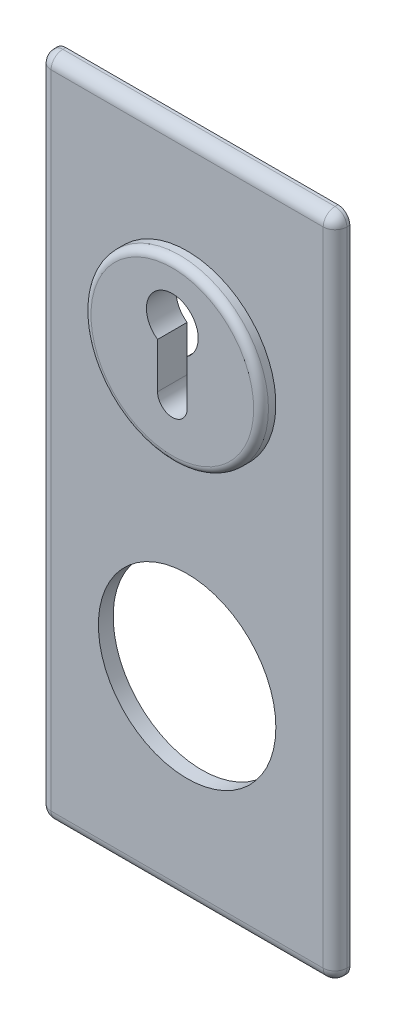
ISO-10303-21;
HEADER;
FILE_DESCRIPTION(('STEP AP214'),'2;1');
FILE_NAME('part.step','',(''),(''),'','','');
FILE_SCHEMA(('AUTOMOTIVE_DESIGN { 1 0 10303 214 1 1 1 1 }'));
ENDSEC;
DATA;
#1=APPLICATION_CONTEXT('core data for automotive mechanical design processes');
#2=APPLICATION_PROTOCOL_DEFINITION('international standard','automotive_design',2000,#1);
#3=PRODUCT_CONTEXT('',#1,'mechanical');
#4=PRODUCT('Part','Part','',(#3));
#5=PRODUCT_RELATED_PRODUCT_CATEGORY('part','',(#4));
#6=PRODUCT_DEFINITION_FORMATION('','',#4);
#7=PRODUCT_DEFINITION_CONTEXT('part definition',#1,'design');
#8=PRODUCT_DEFINITION('design','',#6,#7);
#9=PRODUCT_DEFINITION_SHAPE('','',#8);
#10=(LENGTH_UNIT() NAMED_UNIT(*) SI_UNIT(.MILLI.,.METRE.));
#11=(NAMED_UNIT(*) PLANE_ANGLE_UNIT() SI_UNIT($,.RADIAN.));
#12=(NAMED_UNIT(*) SI_UNIT($,.STERADIAN.) SOLID_ANGLE_UNIT());
#13=UNCERTAINTY_MEASURE_WITH_UNIT(LENGTH_MEASURE(1.E-05),#10,'distance_accuracy_value','');
#14=(GEOMETRIC_REPRESENTATION_CONTEXT(3) GLOBAL_UNCERTAINTY_ASSIGNED_CONTEXT((#13)) GLOBAL_UNIT_ASSIGNED_CONTEXT((#10,
#11,#12)) REPRESENTATION_CONTEXT('',''));
#15=CARTESIAN_POINT('',(0.,0.,0.));
#16=DIRECTION('',(0.,0.,1.));
#17=DIRECTION('',(1.,0.,0.));
#18=AXIS2_PLACEMENT_3D('',#15,#16,#17);
#19=CARTESIAN_POINT('',(0.,0.,2.54));
#20=DIRECTION('',(0.,0.,-1.));
#21=DIRECTION('',(-1.,0.,0.));
#22=AXIS2_PLACEMENT_3D('',#19,#20,#21);
#23=PLANE('',#22);
#24=DIRECTION('',(0.,1.,0.));
#25=VECTOR('',#24,1.);
#26=CARTESIAN_POINT('',(23.368,0.,2.54));
#27=LINE('',#26,#25);
#28=CARTESIAN_POINT('',(23.368,-55.118,2.54));
#29=VERTEX_POINT('',#28);
#30=CARTESIAN_POINT('',(23.368,55.118,2.54));
#31=VERTEX_POINT('',#30);
#32=EDGE_CURVE('E213',#29,#31,#27,.T.);
#33=ORIENTED_EDGE('',*,*,#32,.T.);
#34=DIRECTION('',(-1.,0.,0.));
#35=VECTOR('',#34,1.);
#36=CARTESIAN_POINT('',(0.,55.118,2.54));
#37=LINE('',#36,#35);
#38=CARTESIAN_POINT('',(-23.368,55.118,2.54));
#39=VERTEX_POINT('',#38);
#40=EDGE_CURVE('E219',#31,#39,#37,.T.);
#41=ORIENTED_EDGE('',*,*,#40,.T.);
#42=DIRECTION('',(0.,-1.,0.));
#43=VECTOR('',#42,1.);
#44=CARTESIAN_POINT('',(-23.368,0.,2.54));
#45=LINE('',#44,#43);
#46=CARTESIAN_POINT('',(-23.368,-55.118,2.54));
#47=VERTEX_POINT('',#46);
#48=EDGE_CURVE('E217',#39,#47,#45,.T.);
#49=ORIENTED_EDGE('',*,*,#48,.T.);
#50=DIRECTION('',(1.,0.,0.));
#51=VECTOR('',#50,1.);
#52=CARTESIAN_POINT('',(0.,-55.118,2.54));
#53=LINE('',#52,#51);
#54=EDGE_CURVE('E215',#47,#29,#53,.T.);
#55=ORIENTED_EDGE('',*,*,#54,.T.);
#56=EDGE_LOOP('',(#33,#41,#49,#55));
#57=FACE_BOUND('',#56,.T.);
#58=CARTESIAN_POINT('',(0.,-23.368,2.54));
#59=DIRECTION('',(0.,0.,1.));
#60=DIRECTION('',(1.,0.,0.));
#61=AXIS2_PLACEMENT_3D('',#58,#59,#60);
#62=CIRCLE('',#61,15.24);
#63=CARTESIAN_POINT('',(15.24,-23.368,2.54));
#64=VERTEX_POINT('',#63);
#65=EDGE_CURVE('E172',#64,#64,#62,.T.);
#66=ORIENTED_EDGE('',*,*,#65,.F.);
#67=EDGE_LOOP('',(#66));
#68=FACE_BOUND('',#67,.T.);
#69=CARTESIAN_POINT('',(0.,24.638,2.54));
#70=DIRECTION('',(0.,0.,-1.));
#71=DIRECTION('',(-1.,0.,0.));
#72=AXIS2_PLACEMENT_3D('',#69,#70,#71);
#73=CIRCLE('',#72,15.24);
#74=CARTESIAN_POINT('',(-15.24,24.638,2.54));
#75=VERTEX_POINT('',#74);
#76=EDGE_CURVE('E234',#75,#75,#73,.F.);
#77=ORIENTED_EDGE('',*,*,#76,.F.);
#78=EDGE_LOOP('',(#77));
#79=FACE_BOUND('',#78,.T.);
#80=ADVANCED_FACE('F35',(#57,#68,#79),#23,.F.);
#81=CARTESIAN_POINT('',(25.4,-57.15,2.54));
#82=DIRECTION('',(-1.,0.,0.));
#83=DIRECTION('',(0.,0.,1.));
#84=AXIS2_PLACEMENT_3D('',#81,#82,#83);
#85=PLANE('',#84);
#86=DIRECTION('',(0.,1.,0.));
#87=VECTOR('',#86,1.);
#88=CARTESIAN_POINT('',(25.4,-57.15,0.));
#89=LINE('',#88,#87);
#90=CARTESIAN_POINT('',(25.4,-55.118,0.));
#91=VERTEX_POINT('',#90);
#92=CARTESIAN_POINT('',(25.4,55.118,0.));
#93=VERTEX_POINT('',#92);
#94=EDGE_CURVE('E179',#91,#93,#89,.T.);
#95=ORIENTED_EDGE('',*,*,#94,.T.);
#96=DIRECTION('',(0.,0.,-1.));
#97=VECTOR('',#96,1.);
#98=CARTESIAN_POINT('',(25.4,55.118,2.54));
#99=LINE('',#98,#97);
#100=CARTESIAN_POINT('',(25.4,55.118,0.508));
#101=VERTEX_POINT('',#100);
#102=EDGE_CURVE('E211',#93,#101,#99,.F.);
#103=ORIENTED_EDGE('',*,*,#102,.T.);
#104=DIRECTION('',(0.,1.,0.));
#105=VECTOR('',#104,1.);
#106=CARTESIAN_POINT('',(25.4,-57.15,0.508));
#107=LINE('',#106,#105);
#108=CARTESIAN_POINT('',(25.4,-55.118,0.508));
#109=VERTEX_POINT('',#108);
#110=EDGE_CURVE('E209',#101,#109,#107,.F.);
#111=ORIENTED_EDGE('',*,*,#110,.T.);
#112=DIRECTION('',(0.,0.,-1.));
#113=VECTOR('',#112,1.);
#114=CARTESIAN_POINT('',(25.4,-55.118,2.54));
#115=LINE('',#114,#113);
#116=EDGE_CURVE('E207',#109,#91,#115,.T.);
#117=ORIENTED_EDGE('',*,*,#116,.T.);
#118=EDGE_LOOP('',(#95,#103,#111,#117));
#119=FACE_BOUND('',#118,.T.);
#120=ADVANCED_FACE('F285',(#119),#85,.F.);
#121=CARTESIAN_POINT('',(-25.4,57.15,2.54));
#122=DIRECTION('',(0.,-1.,0.));
#123=DIRECTION('',(0.,0.,-1.));
#124=AXIS2_PLACEMENT_3D('',#121,#122,#123);
#125=PLANE('',#124);
#126=DIRECTION('',(-1.,0.,0.));
#127=VECTOR('',#126,1.);
#128=CARTESIAN_POINT('',(-25.4,57.15,0.508));
#129=LINE('',#128,#127);
#130=CARTESIAN_POINT('',(-23.368,57.15,0.508));
#131=VERTEX_POINT('',#130);
#132=CARTESIAN_POINT('',(23.368,57.15,0.508));
#133=VERTEX_POINT('',#132);
#134=EDGE_CURVE('E194',#131,#133,#129,.F.);
#135=ORIENTED_EDGE('',*,*,#134,.T.);
#136=DIRECTION('',(0.,0.,-1.));
#137=VECTOR('',#136,1.);
#138=CARTESIAN_POINT('',(23.368,57.15,2.54));
#139=LINE('',#138,#137);
#140=CARTESIAN_POINT('',(23.368,57.15,0.));
#141=VERTEX_POINT('',#140);
#142=EDGE_CURVE('E196',#133,#141,#139,.T.);
#143=ORIENTED_EDGE('',*,*,#142,.T.);
#144=DIRECTION('',(-1.,0.,0.));
#145=VECTOR('',#144,1.);
#146=CARTESIAN_POINT('',(-25.4,57.15,0.));
#147=LINE('',#146,#145);
#148=CARTESIAN_POINT('',(-23.368,57.15,0.));
#149=VERTEX_POINT('',#148);
#150=EDGE_CURVE('E182',#141,#149,#147,.T.);
#151=ORIENTED_EDGE('',*,*,#150,.T.);
#152=DIRECTION('',(0.,0.,-1.));
#153=VECTOR('',#152,1.);
#154=CARTESIAN_POINT('',(-23.368,57.15,2.54));
#155=LINE('',#154,#153);
#156=EDGE_CURVE('E192',#149,#131,#155,.F.);
#157=ORIENTED_EDGE('',*,*,#156,.T.);
#158=EDGE_LOOP('',(#135,#143,#151,#157));
#159=FACE_BOUND('',#158,.T.);
#160=ADVANCED_FACE('F291',(#159),#125,.F.);
#161=CARTESIAN_POINT('',(-25.4,-57.15,2.54));
#162=DIRECTION('',(1.,0.,0.));
#163=DIRECTION('',(0.,0.,-1.));
#164=AXIS2_PLACEMENT_3D('',#161,#162,#163);
#165=PLANE('',#164);
#166=DIRECTION('',(0.,-1.,0.));
#167=VECTOR('',#166,1.);
#168=CARTESIAN_POINT('',(-25.4,-57.15,0.508));
#169=LINE('',#168,#167);
#170=CARTESIAN_POINT('',(-25.4,-55.118,0.508));
#171=VERTEX_POINT('',#170);
#172=CARTESIAN_POINT('',(-25.4,55.118,0.508));
#173=VERTEX_POINT('',#172);
#174=EDGE_CURVE('E224',#171,#173,#169,.F.);
#175=ORIENTED_EDGE('',*,*,#174,.T.);
#176=DIRECTION('',(0.,0.,-1.));
#177=VECTOR('',#176,1.);
#178=CARTESIAN_POINT('',(-25.4,55.118,2.54));
#179=LINE('',#178,#177);
#180=CARTESIAN_POINT('',(-25.4,55.118,0.));
#181=VERTEX_POINT('',#180);
#182=EDGE_CURVE('E226',#173,#181,#179,.T.);
#183=ORIENTED_EDGE('',*,*,#182,.T.);
#184=DIRECTION('',(0.,-1.,0.));
#185=VECTOR('',#184,1.);
#186=CARTESIAN_POINT('',(-25.4,-57.15,0.));
#187=LINE('',#186,#185);
#188=CARTESIAN_POINT('',(-25.4,-55.118,0.));
#189=VERTEX_POINT('',#188);
#190=EDGE_CURVE('E186',#181,#189,#187,.T.);
#191=ORIENTED_EDGE('',*,*,#190,.T.);
#192=DIRECTION('',(0.,0.,-1.));
#193=VECTOR('',#192,1.);
#194=CARTESIAN_POINT('',(-25.4,-55.118,2.54));
#195=LINE('',#194,#193);
#196=EDGE_CURVE('E222',#189,#171,#195,.F.);
#197=ORIENTED_EDGE('',*,*,#196,.T.);
#198=EDGE_LOOP('',(#175,#183,#191,#197));
#199=FACE_BOUND('',#198,.T.);
#200=ADVANCED_FACE('F307',(#199),#165,.F.);
#201=CARTESIAN_POINT('',(-25.4,-57.15,2.54));
#202=DIRECTION('',(0.,1.,0.));
#203=DIRECTION('',(0.,0.,1.));
#204=AXIS2_PLACEMENT_3D('',#201,#202,#203);
#205=PLANE('',#204);
#206=DIRECTION('',(1.,0.,0.));
#207=VECTOR('',#206,1.);
#208=CARTESIAN_POINT('',(-25.4,-57.15,0.508));
#209=LINE('',#208,#207);
#210=CARTESIAN_POINT('',(23.368,-57.15,0.508));
#211=VERTEX_POINT('',#210);
#212=CARTESIAN_POINT('',(-23.368,-57.15,0.508));
#213=VERTEX_POINT('',#212);
#214=EDGE_CURVE('E230',#211,#213,#209,.F.);
#215=ORIENTED_EDGE('',*,*,#214,.T.);
#216=DIRECTION('',(0.,0.,-1.));
#217=VECTOR('',#216,1.);
#218=CARTESIAN_POINT('',(-23.368,-57.15,2.54));
#219=LINE('',#218,#217);
#220=CARTESIAN_POINT('',(-23.368,-57.15,0.));
#221=VERTEX_POINT('',#220);
#222=EDGE_CURVE('E232',#213,#221,#219,.T.);
#223=ORIENTED_EDGE('',*,*,#222,.T.);
#224=DIRECTION('',(1.,0.,0.));
#225=VECTOR('',#224,1.);
#226=CARTESIAN_POINT('',(-25.4,-57.15,0.));
#227=LINE('',#226,#225);
#228=CARTESIAN_POINT('',(23.368,-57.15,0.));
#229=VERTEX_POINT('',#228);
#230=EDGE_CURVE('E189',#221,#229,#227,.T.);
#231=ORIENTED_EDGE('',*,*,#230,.T.);
#232=DIRECTION('',(0.,0.,-1.));
#233=VECTOR('',#232,1.);
#234=CARTESIAN_POINT('',(23.368,-57.15,2.54));
#235=LINE('',#234,#233);
#236=EDGE_CURVE('E228',#229,#211,#235,.F.);
#237=ORIENTED_EDGE('',*,*,#236,.T.);
#238=EDGE_LOOP('',(#215,#223,#231,#237));
#239=FACE_BOUND('',#238,.T.);
#240=ADVANCED_FACE('F303',(#239),#205,.F.);
#241=CARTESIAN_POINT('',(0.,0.,0.));
#242=DIRECTION('',(0.,0.,-1.));
#243=DIRECTION('',(-1.,0.,0.));
#244=AXIS2_PLACEMENT_3D('',#241,#242,#243);
#245=PLANE('',#244);
#246=CARTESIAN_POINT('',(0.,30.353,0.));
#247=DIRECTION('',(0.,0.,-1.));
#248=DIRECTION('',(-1.,0.,0.));
#249=AXIS2_PLACEMENT_3D('',#246,#247,#248);
#250=CIRCLE('',#249,4.445);
#251=CARTESIAN_POINT('',(-2.54,26.7052027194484,0.));
#252=VERTEX_POINT('',#251);
#253=CARTESIAN_POINT('',(2.54,26.7052027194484,0.));
#254=VERTEX_POINT('',#253);
#255=EDGE_CURVE('E170',#252,#254,#250,.T.);
#256=ORIENTED_EDGE('',*,*,#255,.F.);
#257=DIRECTION('',(0.,1.,0.));
#258=VECTOR('',#257,1.);
#259=CARTESIAN_POINT('',(-2.54,0.,0.));
#260=LINE('',#259,#258);
#261=CARTESIAN_POINT('',(-2.54,18.923,0.));
#262=VERTEX_POINT('',#261);
#263=EDGE_CURVE('E162',#262,#252,#260,.T.);
#264=ORIENTED_EDGE('',*,*,#263,.F.);
#265=CARTESIAN_POINT('',(0.,18.923,0.));
#266=DIRECTION('',(0.,0.,-1.));
#267=DIRECTION('',(-1.,0.,0.));
#268=AXIS2_PLACEMENT_3D('',#265,#266,#267);
#269=CIRCLE('',#268,2.54);
#270=CARTESIAN_POINT('',(2.54,18.923,0.));
#271=VERTEX_POINT('',#270);
#272=EDGE_CURVE('E142',#271,#262,#269,.T.);
#273=ORIENTED_EDGE('',*,*,#272,.F.);
#274=DIRECTION('',(0.,1.,0.));
#275=VECTOR('',#274,1.);
#276=CARTESIAN_POINT('',(2.54,0.,0.));
#277=LINE('',#276,#275);
#278=EDGE_CURVE('E167',#271,#254,#277,.T.);
#279=ORIENTED_EDGE('',*,*,#278,.T.);
#280=EDGE_LOOP('',(#256,#264,#273,#279));
#281=FACE_BOUND('',#280,.T.);
#282=CARTESIAN_POINT('',(0.,-23.368,0.));
#283=DIRECTION('',(0.,0.,1.));
#284=DIRECTION('',(1.,0.,0.));
#285=AXIS2_PLACEMENT_3D('',#282,#283,#284);
#286=CIRCLE('',#285,15.24);
#287=CARTESIAN_POINT('',(15.24,-23.368,0.));
#288=VERTEX_POINT('',#287);
#289=EDGE_CURVE('E173',#288,#288,#286,.T.);
#290=ORIENTED_EDGE('',*,*,#289,.T.);
#291=EDGE_LOOP('',(#290));
#292=FACE_BOUND('',#291,.T.);
#293=ORIENTED_EDGE('',*,*,#150,.F.);
#294=CARTESIAN_POINT('',(23.368,55.118,0.));
#295=DIRECTION('',(0.,0.,-1.));
#296=DIRECTION('',(-1.,0.,0.));
#297=AXIS2_PLACEMENT_3D('',#294,#295,#296);
#298=CIRCLE('',#297,2.032);
#299=EDGE_CURVE('E205',#141,#93,#298,.T.);
#300=ORIENTED_EDGE('',*,*,#299,.T.);
#301=ORIENTED_EDGE('',*,*,#94,.F.);
#302=CARTESIAN_POINT('',(23.368,-55.118,0.));
#303=DIRECTION('',(0.,0.,-1.));
#304=DIRECTION('',(-1.,0.,0.));
#305=AXIS2_PLACEMENT_3D('',#302,#303,#304);
#306=CIRCLE('',#305,2.032);
#307=EDGE_CURVE('E199',#91,#229,#306,.T.);
#308=ORIENTED_EDGE('',*,*,#307,.T.);
#309=ORIENTED_EDGE('',*,*,#230,.F.);
#310=CARTESIAN_POINT('',(-23.368,-55.118,0.));
#311=DIRECTION('',(0.,0.,-1.));
#312=DIRECTION('',(-1.,0.,0.));
#313=AXIS2_PLACEMENT_3D('',#310,#311,#312);
#314=CIRCLE('',#313,2.032);
#315=EDGE_CURVE('E201',#221,#189,#314,.T.);
#316=ORIENTED_EDGE('',*,*,#315,.T.);
#317=ORIENTED_EDGE('',*,*,#190,.F.);
#318=CARTESIAN_POINT('',(-23.368,55.118,0.));
#319=DIRECTION('',(0.,0.,-1.));
#320=DIRECTION('',(-1.,0.,0.));
#321=AXIS2_PLACEMENT_3D('',#318,#319,#320);
#322=CIRCLE('',#321,2.032);
#323=EDGE_CURVE('E203',#181,#149,#322,.T.);
#324=ORIENTED_EDGE('',*,*,#323,.T.);
#325=EDGE_LOOP('',(#293,#300,#301,#308,#309,#316,#317,#324));
#326=FACE_BOUND('',#325,.T.);
#327=ADVANCED_FACE('F299',(#281,#292,#326),#245,.T.);
#328=CARTESIAN_POINT('',(-23.368,-55.118,2.54));
#329=DIRECTION('',(0.,0.,-1.));
#330=DIRECTION('',(-1.,0.,0.));
#331=AXIS2_PLACEMENT_3D('',#328,#329,#330);
#332=CYLINDRICAL_SURFACE('',#331,2.032);
#333=CARTESIAN_POINT('',(-23.368,-55.118,0.508));
#334=DIRECTION('',(0.,0.,1.));
#335=DIRECTION('',(1.,0.,0.));
#336=AXIS2_PLACEMENT_3D('',#333,#334,#335);
#337=CIRCLE('',#336,2.032);
#338=EDGE_CURVE('E183',#171,#213,#337,.T.);
#339=ORIENTED_EDGE('',*,*,#338,.F.);
#340=ORIENTED_EDGE('',*,*,#196,.F.);
#341=ORIENTED_EDGE('',*,*,#315,.F.);
#342=ORIENTED_EDGE('',*,*,#222,.F.);
#343=EDGE_LOOP('',(#339,#340,#341,#342));
#344=FACE_BOUND('',#343,.T.);
#345=ADVANCED_FACE('F302',(#344),#332,.T.);
#346=CARTESIAN_POINT('',(-23.368,-55.118,0.508));
#347=DIRECTION('',(0.,0.,1.));
#348=DIRECTION('',(1.,0.,0.));
#349=AXIS2_PLACEMENT_3D('',#346,#347,#348);
#350=SPHERICAL_SURFACE('',#349,2.032);
#351=CARTESIAN_POINT('',(-23.368,-55.118,0.508));
#352=DIRECTION('',(0.,-1.,0.));
#353=DIRECTION('',(0.,0.,-1.));
#354=AXIS2_PLACEMENT_3D('',#351,#352,#353);
#355=CIRCLE('',#354,2.032);
#356=EDGE_CURVE('E260',#171,#47,#355,.F.);
#357=ORIENTED_EDGE('',*,*,#356,.F.);
#358=ORIENTED_EDGE('',*,*,#338,.T.);
#359=CARTESIAN_POINT('',(-23.368,-55.118,0.508));
#360=DIRECTION('',(-1.,0.,0.));
#361=DIRECTION('',(0.,0.,1.));
#362=AXIS2_PLACEMENT_3D('',#359,#360,#361);
#363=CIRCLE('',#362,2.032);
#364=EDGE_CURVE('E263',#47,#213,#363,.F.);
#365=ORIENTED_EDGE('',*,*,#364,.F.);
#366=EDGE_LOOP('',(#357,#358,#365));
#367=FACE_BOUND('',#366,.T.);
#368=ADVANCED_FACE('F354',(#367),#350,.T.);
#369=CARTESIAN_POINT('',(23.368,-55.118,2.54));
#370=DIRECTION('',(0.,0.,-1.));
#371=DIRECTION('',(-1.,0.,0.));
#372=AXIS2_PLACEMENT_3D('',#369,#370,#371);
#373=CYLINDRICAL_SURFACE('',#372,2.032);
#374=ORIENTED_EDGE('',*,*,#307,.F.);
#375=ORIENTED_EDGE('',*,*,#116,.F.);
#376=CARTESIAN_POINT('',(23.368,-55.118,0.508));
#377=DIRECTION('',(0.,0.,1.));
#378=DIRECTION('',(1.,0.,0.));
#379=AXIS2_PLACEMENT_3D('',#376,#377,#378);
#380=CIRCLE('',#379,2.032);
#381=EDGE_CURVE('E257',#211,#109,#380,.T.);
#382=ORIENTED_EDGE('',*,*,#381,.F.);
#383=ORIENTED_EDGE('',*,*,#236,.F.);
#384=EDGE_LOOP('',(#374,#375,#382,#383));
#385=FACE_BOUND('',#384,.T.);
#386=ADVANCED_FACE('F350',(#385),#373,.T.);
#387=CARTESIAN_POINT('',(0.,-55.118,0.508));
#388=DIRECTION('',(1.,0.,0.));
#389=DIRECTION('',(0.,0.,-1.));
#390=AXIS2_PLACEMENT_3D('',#387,#388,#389);
#391=CYLINDRICAL_SURFACE('',#390,2.032);
#392=ORIENTED_EDGE('',*,*,#364,.T.);
#393=ORIENTED_EDGE('',*,*,#214,.F.);
#394=CARTESIAN_POINT('',(23.368,-55.118,0.508));
#395=DIRECTION('',(1.,0.,0.));
#396=DIRECTION('',(0.,0.,-1.));
#397=AXIS2_PLACEMENT_3D('',#394,#395,#396);
#398=CIRCLE('',#397,2.032);
#399=EDGE_CURVE('E254',#29,#211,#398,.T.);
#400=ORIENTED_EDGE('',*,*,#399,.F.);
#401=ORIENTED_EDGE('',*,*,#54,.F.);
#402=EDGE_LOOP('',(#392,#393,#400,#401));
#403=FACE_BOUND('',#402,.T.);
#404=ADVANCED_FACE('F346',(#403),#391,.T.);
#405=CARTESIAN_POINT('',(-23.368,0.,0.508));
#406=DIRECTION('',(0.,-1.,0.));
#407=DIRECTION('',(0.,0.,-1.));
#408=AXIS2_PLACEMENT_3D('',#405,#406,#407);
#409=CYLINDRICAL_SURFACE('',#408,2.032);
#410=ORIENTED_EDGE('',*,*,#356,.T.);
#411=ORIENTED_EDGE('',*,*,#48,.F.);
#412=CARTESIAN_POINT('',(-23.368,55.118,0.508));
#413=DIRECTION('',(0.,1.,0.));
#414=DIRECTION('',(0.,0.,1.));
#415=AXIS2_PLACEMENT_3D('',#412,#413,#414);
#416=CIRCLE('',#415,2.032);
#417=EDGE_CURVE('E251',#173,#39,#416,.T.);
#418=ORIENTED_EDGE('',*,*,#417,.F.);
#419=ORIENTED_EDGE('',*,*,#174,.F.);
#420=EDGE_LOOP('',(#410,#411,#418,#419));
#421=FACE_BOUND('',#420,.T.);
#422=ADVANCED_FACE('F342',(#421),#409,.T.);
#423=CARTESIAN_POINT('',(-23.368,55.118,2.54));
#424=DIRECTION('',(0.,0.,-1.));
#425=DIRECTION('',(-1.,0.,0.));
#426=AXIS2_PLACEMENT_3D('',#423,#424,#425);
#427=CYLINDRICAL_SURFACE('',#426,2.032);
#428=ORIENTED_EDGE('',*,*,#323,.F.);
#429=ORIENTED_EDGE('',*,*,#182,.F.);
#430=CARTESIAN_POINT('',(-23.368,55.118,0.508));
#431=DIRECTION('',(0.,0.,1.));
#432=DIRECTION('',(1.,0.,0.));
#433=AXIS2_PLACEMENT_3D('',#430,#431,#432);
#434=CIRCLE('',#433,2.032);
#435=EDGE_CURVE('E248',#131,#173,#434,.T.);
#436=ORIENTED_EDGE('',*,*,#435,.F.);
#437=ORIENTED_EDGE('',*,*,#156,.F.);
#438=EDGE_LOOP('',(#428,#429,#436,#437));
#439=FACE_BOUND('',#438,.T.);
#440=ADVANCED_FACE('F338',(#439),#427,.T.);
#441=CARTESIAN_POINT('',(23.368,-55.118,0.508));
#442=DIRECTION('',(0.,0.,1.));
#443=DIRECTION('',(1.,0.,0.));
#444=AXIS2_PLACEMENT_3D('',#441,#442,#443);
#445=SPHERICAL_SURFACE('',#444,2.032);
#446=ORIENTED_EDGE('',*,*,#399,.T.);
#447=ORIENTED_EDGE('',*,*,#381,.T.);
#448=CARTESIAN_POINT('',(23.368,-55.118,0.508));
#449=DIRECTION('',(0.,-1.,0.));
#450=DIRECTION('',(0.,0.,-1.));
#451=AXIS2_PLACEMENT_3D('',#448,#449,#450);
#452=CIRCLE('',#451,2.032);
#453=EDGE_CURVE('E245',#29,#109,#452,.F.);
#454=ORIENTED_EDGE('',*,*,#453,.F.);
#455=EDGE_LOOP('',(#446,#447,#454));
#456=FACE_BOUND('',#455,.T.);
#457=ADVANCED_FACE('F334',(#456),#445,.T.);
#458=CARTESIAN_POINT('',(-23.368,55.118,0.508));
#459=DIRECTION('',(0.,0.,1.));
#460=DIRECTION('',(1.,0.,0.));
#461=AXIS2_PLACEMENT_3D('',#458,#459,#460);
#462=SPHERICAL_SURFACE('',#461,2.032);
#463=ORIENTED_EDGE('',*,*,#435,.T.);
#464=ORIENTED_EDGE('',*,*,#417,.T.);
#465=CARTESIAN_POINT('',(-23.368,55.118,0.508));
#466=DIRECTION('',(-1.,0.,0.));
#467=DIRECTION('',(0.,0.,1.));
#468=AXIS2_PLACEMENT_3D('',#465,#466,#467);
#469=CIRCLE('',#468,2.032);
#470=EDGE_CURVE('E243',#131,#39,#469,.F.);
#471=ORIENTED_EDGE('',*,*,#470,.F.);
#472=EDGE_LOOP('',(#463,#464,#471));
#473=FACE_BOUND('',#472,.T.);
#474=ADVANCED_FACE('F330',(#473),#462,.T.);
#475=CARTESIAN_POINT('',(23.368,0.,0.508));
#476=DIRECTION('',(0.,1.,0.));
#477=DIRECTION('',(0.,0.,1.));
#478=AXIS2_PLACEMENT_3D('',#475,#476,#477);
#479=CYLINDRICAL_SURFACE('',#478,2.032);
#480=ORIENTED_EDGE('',*,*,#453,.T.);
#481=ORIENTED_EDGE('',*,*,#110,.F.);
#482=CARTESIAN_POINT('',(23.368,55.118,0.508));
#483=DIRECTION('',(0.,1.,0.));
#484=DIRECTION('',(0.,0.,1.));
#485=AXIS2_PLACEMENT_3D('',#482,#483,#484);
#486=CIRCLE('',#485,2.032);
#487=EDGE_CURVE('E240',#31,#101,#486,.T.);
#488=ORIENTED_EDGE('',*,*,#487,.F.);
#489=ORIENTED_EDGE('',*,*,#32,.F.);
#490=EDGE_LOOP('',(#480,#481,#488,#489));
#491=FACE_BOUND('',#490,.T.);
#492=ADVANCED_FACE('F326',(#491),#479,.T.);
#493=CARTESIAN_POINT('',(0.,55.118,0.508));
#494=DIRECTION('',(-1.,0.,0.));
#495=DIRECTION('',(0.,0.,1.));
#496=AXIS2_PLACEMENT_3D('',#493,#494,#495);
#497=CYLINDRICAL_SURFACE('',#496,2.032);
#498=ORIENTED_EDGE('',*,*,#470,.T.);
#499=ORIENTED_EDGE('',*,*,#40,.F.);
#500=CARTESIAN_POINT('',(23.368,55.118,0.508));
#501=DIRECTION('',(1.,0.,0.));
#502=DIRECTION('',(0.,0.,-1.));
#503=AXIS2_PLACEMENT_3D('',#500,#501,#502);
#504=CIRCLE('',#503,2.032);
#505=EDGE_CURVE('E237',#133,#31,#504,.T.);
#506=ORIENTED_EDGE('',*,*,#505,.F.);
#507=ORIENTED_EDGE('',*,*,#134,.F.);
#508=EDGE_LOOP('',(#498,#499,#506,#507));
#509=FACE_BOUND('',#508,.T.);
#510=ADVANCED_FACE('F322',(#509),#497,.T.);
#511=CARTESIAN_POINT('',(23.368,55.118,0.508));
#512=DIRECTION('',(0.,0.,1.));
#513=DIRECTION('',(1.,0.,0.));
#514=AXIS2_PLACEMENT_3D('',#511,#512,#513);
#515=SPHERICAL_SURFACE('',#514,2.032);
#516=ORIENTED_EDGE('',*,*,#505,.T.);
#517=ORIENTED_EDGE('',*,*,#487,.T.);
#518=CARTESIAN_POINT('',(23.368,55.118,0.508));
#519=DIRECTION('',(0.,0.,1.));
#520=DIRECTION('',(1.,0.,0.));
#521=AXIS2_PLACEMENT_3D('',#518,#519,#520);
#522=CIRCLE('',#521,2.032);
#523=EDGE_CURVE('E176',#133,#101,#522,.F.);
#524=ORIENTED_EDGE('',*,*,#523,.F.);
#525=EDGE_LOOP('',(#516,#517,#524));
#526=FACE_BOUND('',#525,.T.);
#527=ADVANCED_FACE('F318',(#526),#515,.T.);
#528=CARTESIAN_POINT('',(23.368,55.118,2.54));
#529=DIRECTION('',(0.,0.,-1.));
#530=DIRECTION('',(-1.,0.,0.));
#531=AXIS2_PLACEMENT_3D('',#528,#529,#530);
#532=CYLINDRICAL_SURFACE('',#531,2.032);
#533=ORIENTED_EDGE('',*,*,#523,.T.);
#534=ORIENTED_EDGE('',*,*,#102,.F.);
#535=ORIENTED_EDGE('',*,*,#299,.F.);
#536=ORIENTED_EDGE('',*,*,#142,.F.);
#537=EDGE_LOOP('',(#533,#534,#535,#536));
#538=FACE_BOUND('',#537,.T.);
#539=ADVANCED_FACE('F315',(#538),#532,.T.);
#540=CARTESIAN_POINT('',(0.,-23.368,0.));
#541=DIRECTION('',(0.,0.,1.));
#542=DIRECTION('',(1.,0.,0.));
#543=AXIS2_PLACEMENT_3D('',#540,#541,#542);
#544=CYLINDRICAL_SURFACE('',#543,15.24);
#545=ORIENTED_EDGE('',*,*,#289,.F.);
#546=EDGE_LOOP('',(#545));
#547=FACE_BOUND('',#546,.T.);
#548=ORIENTED_EDGE('',*,*,#65,.T.);
#549=EDGE_LOOP('',(#548));
#550=FACE_BOUND('',#549,.T.);
#551=ADVANCED_FACE('F297',(#547,#550),#544,.F.);
#552=CARTESIAN_POINT('',(0.,24.638,5.08));
#553=DIRECTION('',(0.,0.,-1.));
#554=DIRECTION('',(-1.,0.,0.));
#555=AXIS2_PLACEMENT_3D('',#552,#553,#554);
#556=CYLINDRICAL_SURFACE('',#555,15.24);
#557=CARTESIAN_POINT('',(0.,24.638,3.81));
#558=DIRECTION('',(0.,0.,1.));
#559=DIRECTION('',(1.,0.,0.));
#560=AXIS2_PLACEMENT_3D('',#557,#558,#559);
#561=CIRCLE('',#560,15.24);
#562=CARTESIAN_POINT('',(15.24,24.638,3.81));
#563=VERTEX_POINT('',#562);
#564=EDGE_CURVE('E11',#563,#563,#561,.F.);
#565=ORIENTED_EDGE('',*,*,#564,.T.);
#566=EDGE_LOOP('',(#565));
#567=FACE_BOUND('',#566,.T.);
#568=ORIENTED_EDGE('',*,*,#76,.T.);
#569=EDGE_LOOP('',(#568));
#570=FACE_BOUND('',#569,.T.);
#571=ADVANCED_FACE('F281',(#567,#570),#556,.T.);
#572=CARTESIAN_POINT('',(0.,24.638,5.08));
#573=DIRECTION('',(0.,0.,1.));
#574=DIRECTION('',(1.,0.,0.));
#575=AXIS2_PLACEMENT_3D('',#572,#573,#574);
#576=PLANE('',#575);
#577=CARTESIAN_POINT('',(0.,30.353,5.08));
#578=DIRECTION('',(0.,0.,1.));
#579=DIRECTION('',(1.,0.,0.));
#580=AXIS2_PLACEMENT_3D('',#577,#578,#579);
#581=CIRCLE('',#580,4.445);
#582=CARTESIAN_POINT('',(2.54,26.7052027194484,5.08));
#583=VERTEX_POINT('',#582);
#584=CARTESIAN_POINT('',(-2.54,26.7052027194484,5.08));
#585=VERTEX_POINT('',#584);
#586=EDGE_CURVE('E58',#583,#585,#581,.T.);
#587=ORIENTED_EDGE('',*,*,#586,.F.);
#588=DIRECTION('',(0.,-1.,0.));
#589=VECTOR('',#588,1.);
#590=CARTESIAN_POINT('',(2.54,0.,5.08));
#591=LINE('',#590,#589);
#592=CARTESIAN_POINT('',(2.54,18.923,5.08));
#593=VERTEX_POINT('',#592);
#594=EDGE_CURVE('E155',#583,#593,#591,.T.);
#595=ORIENTED_EDGE('',*,*,#594,.T.);
#596=CARTESIAN_POINT('',(0.,18.923,5.08));
#597=DIRECTION('',(0.,0.,1.));
#598=DIRECTION('',(1.,0.,0.));
#599=AXIS2_PLACEMENT_3D('',#596,#597,#598);
#600=CIRCLE('',#599,2.54);
#601=CARTESIAN_POINT('',(-2.54,18.923,5.08));
#602=VERTEX_POINT('',#601);
#603=EDGE_CURVE('E139',#602,#593,#600,.T.);
#604=ORIENTED_EDGE('',*,*,#603,.F.);
#605=DIRECTION('',(0.,-1.,0.));
#606=VECTOR('',#605,1.);
#607=CARTESIAN_POINT('',(-2.54,0.,5.08));
#608=LINE('',#607,#606);
#609=EDGE_CURVE('E148',#585,#602,#608,.T.);
#610=ORIENTED_EDGE('',*,*,#609,.F.);
#611=EDGE_LOOP('',(#587,#595,#604,#610));
#612=FACE_BOUND('',#611,.T.);
#613=CARTESIAN_POINT('',(0.,24.638,5.08));
#614=DIRECTION('',(0.,0.,1.));
#615=DIRECTION('',(1.,0.,0.));
#616=AXIS2_PLACEMENT_3D('',#613,#614,#615);
#617=CIRCLE('',#616,13.97);
#618=CARTESIAN_POINT('',(13.97,24.638,5.08));
#619=VERTEX_POINT('',#618);
#620=EDGE_CURVE('E43',#619,#619,#617,.T.);
#621=ORIENTED_EDGE('',*,*,#620,.T.);
#622=EDGE_LOOP('',(#621));
#623=FACE_BOUND('',#622,.T.);
#624=ADVANCED_FACE('F152',(#612,#623),#576,.T.);
#625=CARTESIAN_POINT('',(0.,24.638,3.81));
#626=DIRECTION('',(0.,0.,1.));
#627=DIRECTION('',(1.,0.,0.));
#628=AXIS2_PLACEMENT_3D('',#625,#626,#627);
#629=TOROIDAL_SURFACE('',#628,13.97,1.27);
#630=ORIENTED_EDGE('',*,*,#564,.F.);
#631=EDGE_LOOP('',(#630));
#632=FACE_BOUND('',#631,.T.);
#633=ORIENTED_EDGE('',*,*,#620,.F.);
#634=EDGE_LOOP('',(#633));
#635=FACE_BOUND('',#634,.T.);
#636=ADVANCED_FACE('F37',(#632,#635),#629,.T.);
#637=CARTESIAN_POINT('',(0.,30.353,-20.32));
#638=DIRECTION('',(0.,0.,1.));
#639=DIRECTION('',(1.,0.,0.));
#640=AXIS2_PLACEMENT_3D('',#637,#638,#639);
#641=CYLINDRICAL_SURFACE('',#640,4.445);
#642=ORIENTED_EDGE('',*,*,#255,.T.);
#643=DIRECTION('',(0.,0.,1.));
#644=VECTOR('',#643,1.);
#645=CARTESIAN_POINT('',(2.54,26.7052027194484,-20.32));
#646=LINE('',#645,#644);
#647=EDGE_CURVE('E160',#254,#583,#646,.T.);
#648=ORIENTED_EDGE('',*,*,#647,.T.);
#649=ORIENTED_EDGE('',*,*,#586,.T.);
#650=DIRECTION('',(0.,0.,1.));
#651=VECTOR('',#650,1.);
#652=CARTESIAN_POINT('',(-2.54,26.7052027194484,-20.32));
#653=LINE('',#652,#651);
#654=EDGE_CURVE('E145',#252,#585,#653,.T.);
#655=ORIENTED_EDGE('',*,*,#654,.F.);
#656=EDGE_LOOP('',(#642,#648,#649,#655));
#657=FACE_BOUND('',#656,.T.);
#658=ADVANCED_FACE('F273',(#657),#641,.F.);
#659=CARTESIAN_POINT('',(2.54,0.,-20.32));
#660=DIRECTION('',(-1.,0.,0.));
#661=DIRECTION('',(0.,-1.,0.));
#662=AXIS2_PLACEMENT_3D('',#659,#660,#661);
#663=PLANE('',#662);
#664=DIRECTION('',(0.,0.,1.));
#665=VECTOR('',#664,1.);
#666=CARTESIAN_POINT('',(2.54,18.923,-20.32));
#667=LINE('',#666,#665);
#668=EDGE_CURVE('E144',#271,#593,#667,.T.);
#669=ORIENTED_EDGE('',*,*,#668,.T.);
#670=ORIENTED_EDGE('',*,*,#594,.F.);
#671=ORIENTED_EDGE('',*,*,#647,.F.);
#672=ORIENTED_EDGE('',*,*,#278,.F.);
#673=EDGE_LOOP('',(#669,#670,#671,#672));
#674=FACE_BOUND('',#673,.T.);
#675=ADVANCED_FACE('F279',(#674),#663,.T.);
#676=CARTESIAN_POINT('',(0.,18.923,-20.32));
#677=DIRECTION('',(0.,0.,1.));
#678=DIRECTION('',(1.,0.,0.));
#679=AXIS2_PLACEMENT_3D('',#676,#677,#678);
#680=CYLINDRICAL_SURFACE('',#679,2.54);
#681=ORIENTED_EDGE('',*,*,#272,.T.);
#682=DIRECTION('',(0.,0.,1.));
#683=VECTOR('',#682,1.);
#684=CARTESIAN_POINT('',(-2.54,18.923,-20.32));
#685=LINE('',#684,#683);
#686=EDGE_CURVE('E50',#262,#602,#685,.T.);
#687=ORIENTED_EDGE('',*,*,#686,.T.);
#688=ORIENTED_EDGE('',*,*,#603,.T.);
#689=ORIENTED_EDGE('',*,*,#668,.F.);
#690=EDGE_LOOP('',(#681,#687,#688,#689));
#691=FACE_BOUND('',#690,.T.);
#692=ADVANCED_FACE('F136',(#691),#680,.F.);
#693=CARTESIAN_POINT('',(-2.54,0.,-20.32));
#694=DIRECTION('',(-1.,0.,0.));
#695=DIRECTION('',(0.,-1.,0.));
#696=AXIS2_PLACEMENT_3D('',#693,#694,#695);
#697=PLANE('',#696);
#698=ORIENTED_EDGE('',*,*,#263,.T.);
#699=ORIENTED_EDGE('',*,*,#654,.T.);
#700=ORIENTED_EDGE('',*,*,#609,.T.);
#701=ORIENTED_EDGE('',*,*,#686,.F.);
#702=EDGE_LOOP('',(#698,#699,#700,#701));
#703=FACE_BOUND('',#702,.T.);
#704=ADVANCED_FACE('F149',(#703),#697,.F.);
#705=CLOSED_SHELL('',(#80,#120,#160,#200,#240,#327,#345,#368,#386,#404,#422,#440,#457,#474,#492,
#510,#527,#539,#551,#571,#624,#636,#658,#675,#692,#704));
#706=MANIFOLD_SOLID_BREP('B2',#705);
#707=ADVANCED_BREP_SHAPE_REPRESENTATION('',(#18,#706),#14);
#708=SHAPE_DEFINITION_REPRESENTATION(#9,#707);
ENDSEC;
END-ISO-10303-21;
